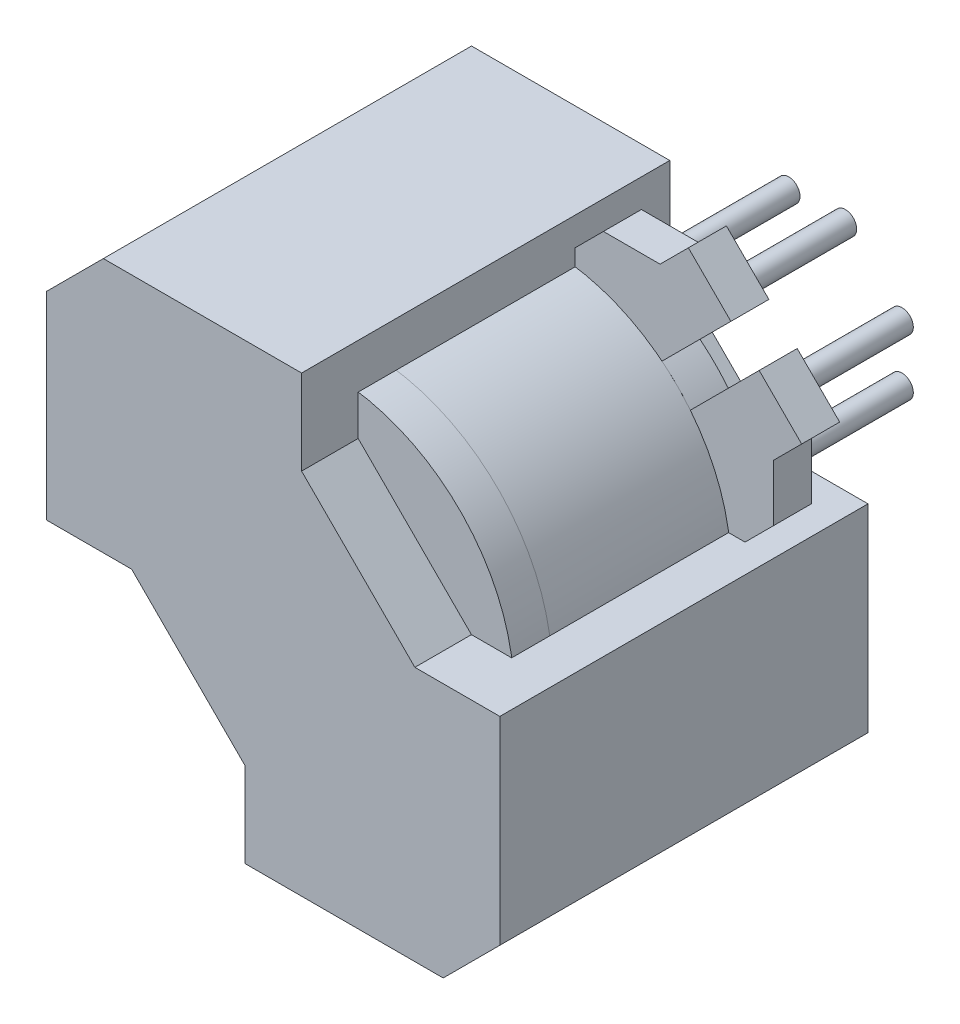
from build123d import *

# Parameters (mm, degrees)
SKETCH1_R                = 8.255
BOSS_EXTRUDE1_DEPTH      = 1.7018
BOSS_EXTRUDE2_DEPTH      = 0.00254
BOSS_EXTRUDE2_DEPTH_BACK = 1.7018
SKETCH3_R                = 0.508
BOSS_EXTRUDE3_DEPTH      = 5.334
BOSS_EXTRUDE3_2_DEPTH    = 5.334
BOSS_EXTRUDE3_3_DEPTH    = 5.334
BOSS_EXTRUDE3_4_DEPTH    = 5.334
BOSS_EXTRUDE3_5_DEPTH    = 5.334
BOSS_EXTRUDE3_6_DEPTH    = 5.334
BOSS_EXTRUDE3_7_DEPTH    = 5.334
BOSS_EXTRUDE3_8_DEPTH    = 5.334
BOSS_EXTRUDE3_9_DEPTH    = 5.334
BOSS_EXTRUDE3_10_DEPTH   = 5.334
BOSS_EXTRUDE3_11_DEPTH   = 5.334
BOSS_EXTRUDE3_12_DEPTH   = 5.334
BOSS_EXTRUDE4_DEPTH      = 2.54
BOSS_EXTRUDE4_DEPTH_BACK = 13.97
SKETCH5_R                = 8.255
BOSS_EXTRUDE5_DEPTH      = 8.0264
SKETCH6_R                = 8.255
BOSS_EXTRUDE6_DEPTH      = 1.7018


with BuildPart() as part:
    # Sketch1 → Boss-Extrude1 (new body)
    with BuildSketch(Plane.XY):
        Circle(SKETCH1_R)
    extrude(amount=BOSS_EXTRUDE1_DEPTH)

    # Sketch2 → Boss-Extrude2 (add, two sides: drawn at the far end of the back side and taken through both)
    with BuildSketch(Plane(origin=(0, 0, 0), x_dir=(-1, 0, 0), z_dir=(0, 0, -1)).offset(-BOSS_EXTRUDE2_DEPTH_BACK)):
        Polygon((5.08, -10.16), (6.35, -11.43), (8.255, -9.525), (3.175, -4.445), (4.445, -3.175), (9.525, -8.255), (11.43, -6.35), (10.16, -5.08), (10.16, -2.54), (-2.54, 10.16), (-5.08, 10.16), (-6.35, 11.43), (-8.255, 9.525), (-3.175, 4.445), (-4.445, 3.175), (-9.525, 8.255), (-11.43, 6.35), (-10.16, 5.08), (-10.16, 2.54), (2.54, -10.16), align=None)
    extrude(amount=BOSS_EXTRUDE2_DEPTH + BOSS_EXTRUDE2_DEPTH_BACK)


with BuildPart() as body_2:
    # Sketch3 → Boss-Extrude3 (new body)
    with BuildSketch(Plane(origin=(0, 0, -0.00254), x_dir=(-1, 0, 0), z_dir=(0, 0, -1))):
        with Locations((6.35, -8.89)):
            Circle(SKETCH3_R)
    extrude(amount=BOSS_EXTRUDE3_DEPTH)


with BuildPart() as body_3:
    # Sketch3 → Boss-Extrude3 2 (new body)
    with BuildSketch(Plane(origin=(0, 0, -0.00254), x_dir=(-1, 0, 0), z_dir=(0, 0, -1))):
        with Locations((3.81, -8.89)):
            Circle(SKETCH3_R)
    extrude(amount=BOSS_EXTRUDE3_2_DEPTH)


with BuildPart() as body_4:
    # Sketch3 → Boss-Extrude3 3 (new body)
    with BuildSketch(Plane(origin=(0, 0, -0.00254), x_dir=(-1, 0, 0), z_dir=(0, 0, -1))):
        with Locations((3.81, -6.35)):
            Circle(SKETCH3_R)
    extrude(amount=BOSS_EXTRUDE3_3_DEPTH)


with BuildPart() as body_5:
    # Sketch3 → Boss-Extrude3 4 (new body)
    with BuildSketch(Plane(origin=(0, 0, -0.00254), x_dir=(-1, 0, 0), z_dir=(0, 0, -1))):
        with Locations((8.89, -6.35)):
            Circle(SKETCH3_R)
    extrude(amount=BOSS_EXTRUDE3_4_DEPTH)


with BuildPart() as body_6:
    # Sketch3 → Boss-Extrude3 5 (new body)
    with BuildSketch(Plane(origin=(0, 0, -0.00254), x_dir=(-1, 0, 0), z_dir=(0, 0, -1))):
        with Locations((8.89, -3.81)):
            Circle(SKETCH3_R)
    extrude(amount=BOSS_EXTRUDE3_5_DEPTH)


with BuildPart() as body_7:
    # Sketch3 → Boss-Extrude3 6 (new body)
    with BuildSketch(Plane(origin=(0, 0, -0.00254), x_dir=(-1, 0, 0), z_dir=(0, 0, -1))):
        with Locations((6.35, -3.81)):
            Circle(SKETCH3_R)
    extrude(amount=BOSS_EXTRUDE3_6_DEPTH)


with BuildPart() as body_8:
    # Sketch3 → Boss-Extrude3 7 (new body)
    with BuildSketch(Plane(origin=(0, 0, -0.00254), x_dir=(-1, 0, 0), z_dir=(0, 0, -1))):
        with Locations((-6.35, 8.89)):
            Circle(SKETCH3_R)
    extrude(amount=BOSS_EXTRUDE3_7_DEPTH)


with BuildPart() as body_9:
    # Sketch3 → Boss-Extrude3 8 (new body)
    with BuildSketch(Plane(origin=(0, 0, -0.00254), x_dir=(-1, 0, 0), z_dir=(0, 0, -1))):
        with Locations((-3.81, 6.35)):
            Circle(SKETCH3_R)
    extrude(amount=BOSS_EXTRUDE3_8_DEPTH)


with BuildPart() as body_10:
    # Sketch3 → Boss-Extrude3 9 (new body)
    with BuildSketch(Plane(origin=(0, 0, -0.00254), x_dir=(-1, 0, 0), z_dir=(0, 0, -1))):
        with Locations((-3.81, 8.89)):
            Circle(SKETCH3_R)
    extrude(amount=BOSS_EXTRUDE3_9_DEPTH)


with BuildPart() as body_11:
    # Sketch3 → Boss-Extrude3 10 (new body)
    with BuildSketch(Plane(origin=(0, 0, -0.00254), x_dir=(-1, 0, 0), z_dir=(0, 0, -1))):
        with Locations((-8.89, 6.35)):
            Circle(SKETCH3_R)
    extrude(amount=BOSS_EXTRUDE3_10_DEPTH)


with BuildPart() as body_12:
    # Sketch3 → Boss-Extrude3 11 (new body)
    with BuildSketch(Plane(origin=(0, 0, -0.00254), x_dir=(-1, 0, 0), z_dir=(0, 0, -1))):
        with Locations((-8.89, 3.81)):
            Circle(SKETCH3_R)
    extrude(amount=BOSS_EXTRUDE3_11_DEPTH)


with BuildPart() as body_13:
    # Sketch3 → Boss-Extrude3 12 (new body)
    with BuildSketch(Plane(origin=(0, 0, -0.00254), x_dir=(-1, 0, 0), z_dir=(0, 0, -1))):
        with Locations((-6.35, 3.81)):
            Circle(SKETCH3_R)
    extrude(amount=BOSS_EXTRUDE3_12_DEPTH)


with BuildPart() as body_14:
    # Sketch4 → Boss-Extrude4 (new, two sides: drawn at the far end of the back side and taken through both)
    with BuildSketch(Plane(origin=(0, 0, -0.00254), x_dir=(-1, 0, 0), z_dir=(0, 0, -1)).offset(-BOSS_EXTRUDE4_DEPTH_BACK)):
        Polygon((1.27, -10.16), (-7.62, -10.16), (-10.16, -7.62), (-10.16, 1.27), (-6.35, 1.27), (-1.27, 6.35), (-1.27, 10.16), (7.62, 10.16), (10.16, 7.62), (10.16, -1.27), (6.35, -1.27), (1.27, -6.35), align=None)
    extrude(amount=BOSS_EXTRUDE4_DEPTH + BOSS_EXTRUDE4_DEPTH_BACK)


with BuildPart() as body_15:
    # Sketch5 → Boss-Extrude5 (new body)
    with BuildSketch(Plane.XY.offset(1.7018)):
        Circle(SKETCH5_R)
    extrude(amount=BOSS_EXTRUDE5_DEPTH)


with BuildPart() as body_16:
    # Sketch6 → Boss-Extrude6 (new body)
    with BuildSketch(Plane.XY.offset(9.7282)):
        Circle(SKETCH6_R)
    extrude(amount=BOSS_EXTRUDE6_DEPTH)


solid = Compound([part.part, body_2.part, body_3.part, body_4.part, body_5.part, body_6.part, body_7.part, body_8.part, body_9.part, body_10.part, body_11.part, body_12.part, body_13.part, body_14.part, body_15.part, body_16.part])
